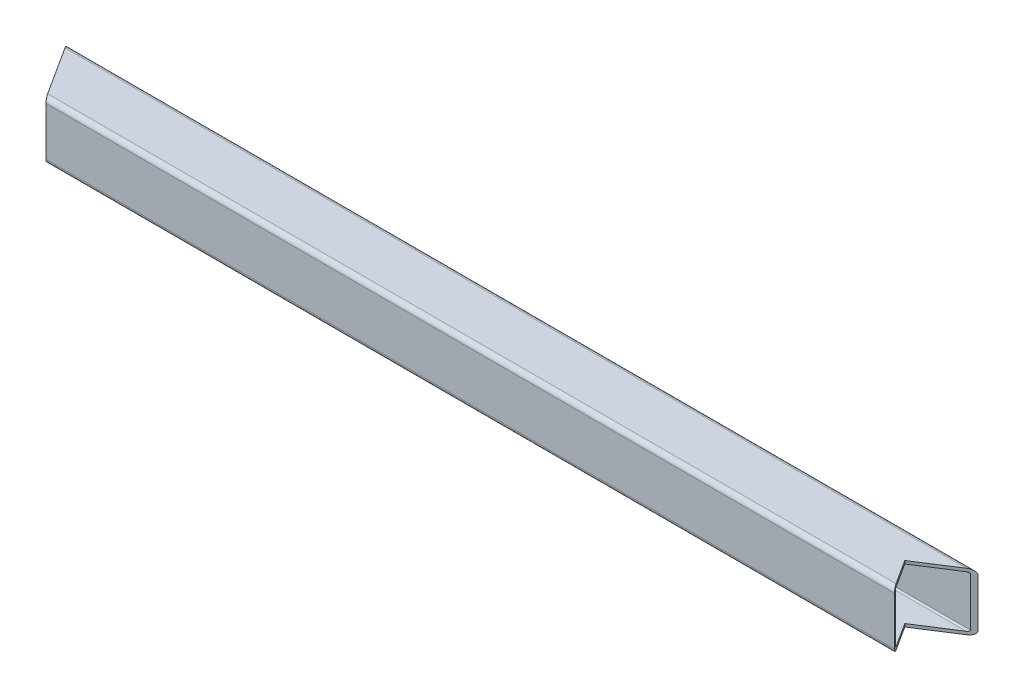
ISO-10303-21;
HEADER;
FILE_DESCRIPTION(('STEP AP214'),'2;1');
FILE_NAME('part.step','',(''),(''),'','','');
FILE_SCHEMA(('AUTOMOTIVE_DESIGN { 1 0 10303 214 1 1 1 1 }'));
ENDSEC;
DATA;
#1=APPLICATION_CONTEXT('core data for automotive mechanical design processes');
#2=APPLICATION_PROTOCOL_DEFINITION('international standard','automotive_design',2000,#1);
#3=PRODUCT_CONTEXT('',#1,'mechanical');
#4=PRODUCT('Part','Part','',(#3));
#5=PRODUCT_RELATED_PRODUCT_CATEGORY('part','',(#4));
#6=PRODUCT_DEFINITION_FORMATION('','',#4);
#7=PRODUCT_DEFINITION_CONTEXT('part definition',#1,'design');
#8=PRODUCT_DEFINITION('design','',#6,#7);
#9=PRODUCT_DEFINITION_SHAPE('','',#8);
#10=(LENGTH_UNIT() NAMED_UNIT(*) SI_UNIT(.MILLI.,.METRE.));
#11=(NAMED_UNIT(*) PLANE_ANGLE_UNIT() SI_UNIT($,.RADIAN.));
#12=(NAMED_UNIT(*) SI_UNIT($,.STERADIAN.) SOLID_ANGLE_UNIT());
#13=UNCERTAINTY_MEASURE_WITH_UNIT(LENGTH_MEASURE(1.E-05),#10,'distance_accuracy_value','');
#14=(GEOMETRIC_REPRESENTATION_CONTEXT(3) GLOBAL_UNCERTAINTY_ASSIGNED_CONTEXT((#13)) GLOBAL_UNIT_ASSIGNED_CONTEXT((#10,
#11,#12)) REPRESENTATION_CONTEXT('',''));
#15=CARTESIAN_POINT('',(0.,0.,0.));
#16=DIRECTION('',(0.,0.,1.));
#17=DIRECTION('',(1.,0.,0.));
#18=AXIS2_PLACEMENT_3D('',#15,#16,#17);
#19=CARTESIAN_POINT('',(698.5,2.54,29.21));
#20=DIRECTION('',(-1.,0.,0.));
#21=DIRECTION('',(0.,0.,1.));
#22=AXIS2_PLACEMENT_3D('',#19,#20,#21);
#23=CYLINDRICAL_SURFACE('',#22,2.54);
#24=DIRECTION('',(-1.,0.,0.));
#25=VECTOR('',#24,1.);
#26=CARTESIAN_POINT('',(698.5,2.54000000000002,31.75));
#27=LINE('',#26,#25);
#28=CARTESIAN_POINT('',(571.772242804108,2.54000000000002,31.75));
#29=VERTEX_POINT('',#28);
#30=CARTESIAN_POINT('',(103.965229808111,2.54000000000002,31.75));
#31=VERTEX_POINT('',#30);
#32=EDGE_CURVE('E238',#29,#31,#27,.T.);
#33=ORIENTED_EDGE('',*,*,#32,.T.);
#34=CARTESIAN_POINT('',(102.335080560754,2.54,29.21));
#35=DIRECTION('',(0.84158635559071,0.,-0.540122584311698));
#36=DIRECTION('',(-0.540122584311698,0.,-0.84158635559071));
#37=AXIS2_PLACEMENT_3D('',#34,#35,#36);
#38=ELLIPSE('',#37,3.01810976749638,2.54);
#39=CARTESIAN_POINT('',(102.335080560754,0.,29.21));
#40=VERTEX_POINT('',#39);
#41=EDGE_CURVE('E54',#31,#40,#38,.T.);
#42=ORIENTED_EDGE('',*,*,#41,.T.);
#43=DIRECTION('',(-1.,0.,0.));
#44=VECTOR('',#43,1.);
#45=CARTESIAN_POINT('',(698.5,0.,29.21));
#46=LINE('',#45,#44);
#47=CARTESIAN_POINT('',(570.142093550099,0.,29.21));
#48=VERTEX_POINT('',#47);
#49=EDGE_CURVE('E180',#48,#40,#46,.T.);
#50=ORIENTED_EDGE('',*,*,#49,.F.);
#51=CARTESIAN_POINT('',(570.142093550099,2.54,29.21));
#52=DIRECTION('',(-0.84158635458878,0.,0.540122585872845));
#53=DIRECTION('',(-0.540122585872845,0.,-0.84158635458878));
#54=AXIS2_PLACEMENT_3D('',#51,#52,#53);
#55=ELLIPSE('',#54,3.01810977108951,2.54);
#56=EDGE_CURVE('E220',#48,#29,#55,.T.);
#57=ORIENTED_EDGE('',*,*,#56,.T.);
#58=EDGE_LOOP('',(#33,#42,#50,#57));
#59=FACE_BOUND('',#58,.T.);
#60=ADVANCED_FACE('F40',(#59),#23,.T.);
#61=CARTESIAN_POINT('',(698.5,0.,29.21));
#62=DIRECTION('',(0.,1.,0.));
#63=DIRECTION('',(0.,0.,1.));
#64=AXIS2_PLACEMENT_3D('',#61,#62,#63);
#65=PLANE('',#64);
#66=ORIENTED_EDGE('',*,*,#49,.T.);
#67=DIRECTION('',(0.540122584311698,0.,0.84158635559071));
#68=VECTOR('',#67,1.);
#69=CARTESIAN_POINT('',(98.4848638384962,0.,23.2108250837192));
#70=LINE('',#69,#68);
#71=CARTESIAN_POINT('',(85.2185134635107,0.,2.54000000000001));
#72=VERTEX_POINT('',#71);
#73=EDGE_CURVE('E164',#72,#40,#70,.T.);
#74=ORIENTED_EDGE('',*,*,#73,.F.);
#75=DIRECTION('',(-1.,0.,0.));
#76=VECTOR('',#75,1.);
#77=CARTESIAN_POINT('',(698.5,0.,2.54000000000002));
#78=LINE('',#77,#76);
#79=CARTESIAN_POINT('',(582.145965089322,0.,2.54000000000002));
#80=VERTEX_POINT('',#79);
#81=EDGE_CURVE('E177',#80,#72,#78,.T.);
#82=ORIENTED_EDGE('',*,*,#81,.F.);
#83=DIRECTION('',(0.841586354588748,0.,-0.540122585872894));
#84=VECTOR('',#83,1.);
#85=CARTESIAN_POINT('',(170.985425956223,0.,266.419152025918));
#86=LINE('',#85,#84);
#87=CARTESIAN_POINT('',(561.520902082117,0.,15.7769807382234));
#88=VERTEX_POINT('',#87);
#89=EDGE_CURVE('E270',#88,#80,#86,.T.);
#90=ORIENTED_EDGE('',*,*,#89,.F.);
#91=DIRECTION('',(-0.540122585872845,0.,-0.84158635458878));
#92=VECTOR('',#91,1.);
#93=CARTESIAN_POINT('',(390.535476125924,0.,-250.642171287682));
#94=LINE('',#93,#92);
#95=EDGE_CURVE('E268',#48,#88,#94,.T.);
#96=ORIENTED_EDGE('',*,*,#95,.F.);
#97=EDGE_LOOP('',(#66,#74,#82,#90,#96));
#98=FACE_BOUND('',#97,.T.);
#99=ADVANCED_FACE('F175',(#98),#65,.F.);
#100=CARTESIAN_POINT('',(698.5,2.54,2.54));
#101=DIRECTION('',(-1.,0.,0.));
#102=DIRECTION('',(0.,0.,1.));
#103=AXIS2_PLACEMENT_3D('',#100,#101,#102);
#104=CYLINDRICAL_SURFACE('',#103,2.54);
#105=ORIENTED_EDGE('',*,*,#81,.T.);
#106=CARTESIAN_POINT('',(85.2185134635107,2.54,2.54));
#107=DIRECTION('',(0.84158635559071,0.,-0.540122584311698));
#108=DIRECTION('',(-0.540122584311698,0.,-0.84158635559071));
#109=AXIS2_PLACEMENT_3D('',#106,#107,#108);
#110=ELLIPSE('',#109,3.01810976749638,2.54);
#111=CARTESIAN_POINT('',(83.5883642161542,2.54000000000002,0.));
#112=VERTEX_POINT('',#111);
#113=EDGE_CURVE('E161',#72,#112,#110,.T.);
#114=ORIENTED_EDGE('',*,*,#113,.T.);
#115=DIRECTION('',(-1.,0.,0.));
#116=VECTOR('',#115,1.);
#117=CARTESIAN_POINT('',(698.5,2.54000000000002,0.));
#118=LINE('',#117,#116);
#119=CARTESIAN_POINT('',(586.103639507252,2.54000000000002,0.));
#120=VERTEX_POINT('',#119);
#121=EDGE_CURVE('E185',#120,#112,#118,.T.);
#122=ORIENTED_EDGE('',*,*,#121,.F.);
#123=CARTESIAN_POINT('',(582.145965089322,2.54,2.54));
#124=DIRECTION('',(-0.540122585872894,0.,-0.841586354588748));
#125=DIRECTION('',(-0.841586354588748,0.,0.540122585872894));
#126=AXIS2_PLACEMENT_3D('',#123,#124,#125);
#127=ELLIPSE('',#126,4.70263615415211,2.54);
#128=EDGE_CURVE('E184',#120,#80,#127,.T.);
#129=ORIENTED_EDGE('',*,*,#128,.T.);
#130=EDGE_LOOP('',(#105,#114,#122,#129));
#131=FACE_BOUND('',#130,.T.);
#132=ADVANCED_FACE('F183',(#131),#104,.T.);
#133=CARTESIAN_POINT('',(698.5,2.54000000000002,0.));
#134=DIRECTION('',(0.,0.,1.));
#135=DIRECTION('',(1.,0.,0.));
#136=AXIS2_PLACEMENT_3D('',#133,#134,#135);
#137=PLANE('',#136);
#138=ORIENTED_EDGE('',*,*,#121,.T.);
#139=DIRECTION('',(0.,1.,0.));
#140=VECTOR('',#139,1.);
#141=CARTESIAN_POINT('',(83.5883642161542,2.54000000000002,0.));
#142=LINE('',#141,#140);
#143=CARTESIAN_POINT('',(83.5883642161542,29.21,0.));
#144=VERTEX_POINT('',#143);
#145=EDGE_CURVE('E166',#112,#144,#142,.T.);
#146=ORIENTED_EDGE('',*,*,#145,.T.);
#147=DIRECTION('',(-1.,0.,0.));
#148=VECTOR('',#147,1.);
#149=CARTESIAN_POINT('',(698.5,29.21,0.));
#150=LINE('',#149,#148);
#151=CARTESIAN_POINT('',(586.103639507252,29.21,0.));
#152=VERTEX_POINT('',#151);
#153=EDGE_CURVE('E189',#152,#144,#150,.T.);
#154=ORIENTED_EDGE('',*,*,#153,.F.);
#155=DIRECTION('',(0.,-1.,0.));
#156=VECTOR('',#155,1.);
#157=CARTESIAN_POINT('',(586.103639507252,2.54000000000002,0.));
#158=LINE('',#157,#156);
#159=EDGE_CURVE('E261',#152,#120,#158,.T.);
#160=ORIENTED_EDGE('',*,*,#159,.T.);
#161=EDGE_LOOP('',(#138,#146,#154,#160));
#162=FACE_BOUND('',#161,.T.);
#163=ADVANCED_FACE('F260',(#162),#137,.F.);
#164=CARTESIAN_POINT('',(698.5,29.21,2.54));
#165=DIRECTION('',(-1.,0.,0.));
#166=DIRECTION('',(0.,0.,1.));
#167=AXIS2_PLACEMENT_3D('',#164,#165,#166);
#168=CYLINDRICAL_SURFACE('',#167,2.54);
#169=ORIENTED_EDGE('',*,*,#153,.T.);
#170=CARTESIAN_POINT('',(85.2185134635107,29.21,2.54));
#171=DIRECTION('',(0.84158635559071,0.,-0.540122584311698));
#172=DIRECTION('',(-0.540122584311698,0.,-0.84158635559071));
#173=AXIS2_PLACEMENT_3D('',#170,#171,#172);
#174=ELLIPSE('',#173,3.01810976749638,2.54);
#175=CARTESIAN_POINT('',(85.2185134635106,31.75,2.53999999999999));
#176=VERTEX_POINT('',#175);
#177=EDGE_CURVE('E256',#144,#176,#174,.T.);
#178=ORIENTED_EDGE('',*,*,#177,.T.);
#179=DIRECTION('',(-1.,0.,0.));
#180=VECTOR('',#179,1.);
#181=CARTESIAN_POINT('',(698.5,31.75,2.54000000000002));
#182=LINE('',#181,#180);
#183=CARTESIAN_POINT('',(582.145965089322,31.75,2.54000000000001));
#184=VERTEX_POINT('',#183);
#185=EDGE_CURVE('E247',#184,#176,#182,.T.);
#186=ORIENTED_EDGE('',*,*,#185,.F.);
#187=CARTESIAN_POINT('',(582.145965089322,29.21,2.54));
#188=DIRECTION('',(-0.540122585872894,0.,-0.841586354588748));
#189=DIRECTION('',(-0.841586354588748,0.,0.540122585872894));
#190=AXIS2_PLACEMENT_3D('',#187,#188,#189);
#191=ELLIPSE('',#190,4.70263615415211,2.54);
#192=EDGE_CURVE('E257',#184,#152,#191,.T.);
#193=ORIENTED_EDGE('',*,*,#192,.T.);
#194=EDGE_LOOP('',(#169,#178,#186,#193));
#195=FACE_BOUND('',#194,.T.);
#196=ADVANCED_FACE('F254',(#195),#168,.T.);
#197=CARTESIAN_POINT('',(698.5,31.75,2.54000000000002));
#198=DIRECTION('',(0.,-1.,0.));
#199=DIRECTION('',(0.,0.,-1.));
#200=AXIS2_PLACEMENT_3D('',#197,#198,#199);
#201=PLANE('',#200);
#202=ORIENTED_EDGE('',*,*,#185,.T.);
#203=DIRECTION('',(0.540122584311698,0.,0.84158635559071));
#204=VECTOR('',#203,1.);
#205=CARTESIAN_POINT('',(264.132597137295,31.7499999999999,281.313108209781));
#206=LINE('',#205,#204);
#207=CARTESIAN_POINT('',(102.335080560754,31.75,29.21));
#208=VERTEX_POINT('',#207);
#209=EDGE_CURVE('E263',#176,#208,#206,.T.);
#210=ORIENTED_EDGE('',*,*,#209,.T.);
#211=DIRECTION('',(-1.,0.,0.));
#212=VECTOR('',#211,1.);
#213=CARTESIAN_POINT('',(698.5,31.75,29.21));
#214=LINE('',#213,#212);
#215=CARTESIAN_POINT('',(570.142093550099,31.75,29.21));
#216=VERTEX_POINT('',#215);
#217=EDGE_CURVE('E244',#216,#208,#214,.T.);
#218=ORIENTED_EDGE('',*,*,#217,.F.);
#219=DIRECTION('',(-0.540122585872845,0.,-0.84158635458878));
#220=VECTOR('',#219,1.);
#221=CARTESIAN_POINT('',(595.465144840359,31.75,68.6668473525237));
#222=LINE('',#221,#220);
#223=CARTESIAN_POINT('',(561.520902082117,31.75,15.7769807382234));
#224=VERTEX_POINT('',#223);
#225=EDGE_CURVE('E299',#216,#224,#222,.T.);
#226=ORIENTED_EDGE('',*,*,#225,.T.);
#227=DIRECTION('',(0.841586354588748,0.,-0.540122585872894));
#228=VECTOR('',#227,1.);
#229=CARTESIAN_POINT('',(664.555757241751,31.75,-50.3498666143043));
#230=LINE('',#229,#228);
#231=EDGE_CURVE('E282',#224,#184,#230,.T.);
#232=ORIENTED_EDGE('',*,*,#231,.T.);
#233=EDGE_LOOP('',(#202,#210,#218,#226,#232));
#234=FACE_BOUND('',#233,.T.);
#235=ADVANCED_FACE('F319',(#234),#201,.F.);
#236=CARTESIAN_POINT('',(698.5,29.21,29.21));
#237=DIRECTION('',(-1.,0.,0.));
#238=DIRECTION('',(0.,0.,1.));
#239=AXIS2_PLACEMENT_3D('',#236,#237,#238);
#240=CYLINDRICAL_SURFACE('',#239,2.54);
#241=ORIENTED_EDGE('',*,*,#217,.T.);
#242=CARTESIAN_POINT('',(102.335080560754,29.21,29.21));
#243=DIRECTION('',(0.84158635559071,0.,-0.540122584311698));
#244=DIRECTION('',(-0.540122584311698,0.,-0.84158635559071));
#245=AXIS2_PLACEMENT_3D('',#242,#243,#244);
#246=ELLIPSE('',#245,3.01810976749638,2.54);
#247=CARTESIAN_POINT('',(103.965229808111,29.21,31.75));
#248=VERTEX_POINT('',#247);
#249=EDGE_CURVE('E309',#208,#248,#246,.T.);
#250=ORIENTED_EDGE('',*,*,#249,.T.);
#251=DIRECTION('',(-1.,0.,0.));
#252=VECTOR('',#251,1.);
#253=CARTESIAN_POINT('',(698.5,29.21,31.75));
#254=LINE('',#253,#252);
#255=CARTESIAN_POINT('',(571.772242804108,29.21,31.75));
#256=VERTEX_POINT('',#255);
#257=EDGE_CURVE('E241',#256,#248,#254,.T.);
#258=ORIENTED_EDGE('',*,*,#257,.F.);
#259=CARTESIAN_POINT('',(570.142093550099,29.21,29.21));
#260=DIRECTION('',(-0.84158635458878,0.,0.540122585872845));
#261=DIRECTION('',(-0.540122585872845,0.,-0.84158635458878));
#262=AXIS2_PLACEMENT_3D('',#259,#260,#261);
#263=ELLIPSE('',#262,3.01810977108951,2.54);
#264=EDGE_CURVE('E296',#256,#216,#263,.T.);
#265=ORIENTED_EDGE('',*,*,#264,.T.);
#266=EDGE_LOOP('',(#241,#250,#258,#265));
#267=FACE_BOUND('',#266,.T.);
#268=ADVANCED_FACE('F321',(#267),#240,.T.);
#269=CARTESIAN_POINT('',(698.5,29.21,31.75));
#270=DIRECTION('',(0.,0.,-1.));
#271=DIRECTION('',(0.,1.,0.));
#272=AXIS2_PLACEMENT_3D('',#269,#270,#271);
#273=PLANE('',#272);
#274=ORIENTED_EDGE('',*,*,#257,.T.);
#275=DIRECTION('',(0.,-1.,0.));
#276=VECTOR('',#275,1.);
#277=CARTESIAN_POINT('',(103.965229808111,29.2100000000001,31.75));
#278=LINE('',#277,#276);
#279=EDGE_CURVE('E307',#248,#31,#278,.T.);
#280=ORIENTED_EDGE('',*,*,#279,.T.);
#281=ORIENTED_EDGE('',*,*,#32,.F.);
#282=DIRECTION('',(0.,1.,0.));
#283=VECTOR('',#282,1.);
#284=CARTESIAN_POINT('',(571.772242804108,29.21,31.75));
#285=LINE('',#284,#283);
#286=EDGE_CURVE('E293',#29,#256,#285,.T.);
#287=ORIENTED_EDGE('',*,*,#286,.T.);
#288=EDGE_LOOP('',(#274,#280,#281,#287));
#289=FACE_BOUND('',#288,.T.);
#290=ADVANCED_FACE('F305',(#289),#273,.F.);
#291=CARTESIAN_POINT('',(698.5,2.54,2.54));
#292=DIRECTION('',(-1.,0.,0.));
#293=DIRECTION('',(0.,0.,1.));
#294=AXIS2_PLACEMENT_3D('',#291,#292,#293);
#295=CYLINDRICAL_SURFACE('',#294,0.889);
#296=CARTESIAN_POINT('',(85.2185134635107,2.54,2.54));
#297=DIRECTION('',(0.84158635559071,0.,-0.540122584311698));
#298=DIRECTION('',(-0.540122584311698,0.,-0.84158635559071));
#299=AXIS2_PLACEMENT_3D('',#296,#297,#298);
#300=ELLIPSE('',#299,1.05633841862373,0.889);
#301=CARTESIAN_POINT('',(85.2185134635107,1.651,2.54000000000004));
#302=VERTEX_POINT('',#301);
#303=CARTESIAN_POINT('',(84.6479612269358,2.54000000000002,1.651));
#304=VERTEX_POINT('',#303);
#305=EDGE_CURVE('E310',#302,#304,#300,.T.);
#306=ORIENTED_EDGE('',*,*,#305,.F.);
#307=DIRECTION('',(-1.,0.,0.));
#308=VECTOR('',#307,1.);
#309=CARTESIAN_POINT('',(698.5,1.651,2.54000000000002));
#310=LINE('',#309,#308);
#311=CARTESIAN_POINT('',(582.145965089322,1.651,2.54000000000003));
#312=VERTEX_POINT('',#311);
#313=EDGE_CURVE('E216',#312,#302,#310,.T.);
#314=ORIENTED_EDGE('',*,*,#313,.F.);
#315=CARTESIAN_POINT('',(582.145965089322,2.54,2.54));
#316=DIRECTION('',(-0.540122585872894,0.,-0.841586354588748));
#317=DIRECTION('',(-0.841586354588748,0.,0.540122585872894));
#318=AXIS2_PLACEMENT_3D('',#315,#316,#317);
#319=ELLIPSE('',#318,1.64592265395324,0.889);
#320=CARTESIAN_POINT('',(583.531151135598,2.54000000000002,1.651));
#321=VERTEX_POINT('',#320);
#322=EDGE_CURVE('E274',#321,#312,#319,.T.);
#323=ORIENTED_EDGE('',*,*,#322,.F.);
#324=DIRECTION('',(-1.,0.,0.));
#325=VECTOR('',#324,1.);
#326=CARTESIAN_POINT('',(698.5,2.54000000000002,1.651));
#327=LINE('',#326,#325);
#328=EDGE_CURVE('E235',#321,#304,#327,.T.);
#329=ORIENTED_EDGE('',*,*,#328,.T.);
#330=EDGE_LOOP('',(#306,#314,#323,#329));
#331=FACE_BOUND('',#330,.T.);
#332=ADVANCED_FACE('F331',(#331),#295,.F.);
#333=CARTESIAN_POINT('',(698.5,2.54000000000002,1.651));
#334=DIRECTION('',(0.,0.,1.));
#335=DIRECTION('',(1.,0.,0.));
#336=AXIS2_PLACEMENT_3D('',#333,#334,#335);
#337=PLANE('',#336);
#338=DIRECTION('',(0.,1.,0.));
#339=VECTOR('',#338,1.);
#340=CARTESIAN_POINT('',(84.6479612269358,2.54000000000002,1.651));
#341=LINE('',#340,#339);
#342=CARTESIAN_POINT('',(84.647961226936,29.21,1.651));
#343=VERTEX_POINT('',#342);
#344=EDGE_CURVE('E313',#304,#343,#341,.T.);
#345=ORIENTED_EDGE('',*,*,#344,.F.);
#346=ORIENTED_EDGE('',*,*,#328,.F.);
#347=DIRECTION('',(0.,-1.,0.));
#348=VECTOR('',#347,1.);
#349=CARTESIAN_POINT('',(583.531151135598,2.54000000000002,1.651));
#350=LINE('',#349,#348);
#351=CARTESIAN_POINT('',(583.531151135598,29.21,1.651));
#352=VERTEX_POINT('',#351);
#353=EDGE_CURVE('E276',#352,#321,#350,.T.);
#354=ORIENTED_EDGE('',*,*,#353,.F.);
#355=DIRECTION('',(-1.,0.,0.));
#356=VECTOR('',#355,1.);
#357=CARTESIAN_POINT('',(698.5,29.21,1.651));
#358=LINE('',#357,#356);
#359=EDGE_CURVE('E232',#352,#343,#358,.T.);
#360=ORIENTED_EDGE('',*,*,#359,.T.);
#361=EDGE_LOOP('',(#345,#346,#354,#360));
#362=FACE_BOUND('',#361,.T.);
#363=ADVANCED_FACE('F336',(#362),#337,.T.);
#364=CARTESIAN_POINT('',(698.5,29.21,2.54));
#365=DIRECTION('',(-1.,0.,0.));
#366=DIRECTION('',(0.,0.,1.));
#367=AXIS2_PLACEMENT_3D('',#364,#365,#366);
#368=CYLINDRICAL_SURFACE('',#367,0.889);
#369=CARTESIAN_POINT('',(85.2185134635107,29.21,2.54));
#370=DIRECTION('',(0.84158635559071,0.,-0.540122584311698));
#371=DIRECTION('',(-0.540122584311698,0.,-0.84158635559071));
#372=AXIS2_PLACEMENT_3D('',#369,#370,#371);
#373=ELLIPSE('',#372,1.05633841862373,0.889);
#374=CARTESIAN_POINT('',(85.2185134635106,30.099,2.53999999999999));
#375=VERTEX_POINT('',#374);
#376=EDGE_CURVE('E339',#343,#375,#373,.T.);
#377=ORIENTED_EDGE('',*,*,#376,.F.);
#378=ORIENTED_EDGE('',*,*,#359,.F.);
#379=CARTESIAN_POINT('',(582.145965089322,29.21,2.54));
#380=DIRECTION('',(-0.540122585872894,0.,-0.841586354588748));
#381=DIRECTION('',(-0.841586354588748,0.,0.540122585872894));
#382=AXIS2_PLACEMENT_3D('',#379,#380,#381);
#383=ELLIPSE('',#382,1.64592265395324,0.889);
#384=CARTESIAN_POINT('',(582.145965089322,30.099,2.54000000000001));
#385=VERTEX_POINT('',#384);
#386=EDGE_CURVE('E278',#385,#352,#383,.T.);
#387=ORIENTED_EDGE('',*,*,#386,.F.);
#388=DIRECTION('',(-1.,0.,0.));
#389=VECTOR('',#388,1.);
#390=CARTESIAN_POINT('',(698.5,30.099,2.54000000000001));
#391=LINE('',#390,#389);
#392=EDGE_CURVE('E229',#385,#375,#391,.T.);
#393=ORIENTED_EDGE('',*,*,#392,.T.);
#394=EDGE_LOOP('',(#377,#378,#387,#393));
#395=FACE_BOUND('',#394,.T.);
#396=ADVANCED_FACE('F364',(#395),#368,.F.);
#397=CARTESIAN_POINT('',(698.5,30.099,2.54000000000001));
#398=DIRECTION('',(0.,-1.,0.));
#399=DIRECTION('',(0.,0.,-1.));
#400=AXIS2_PLACEMENT_3D('',#397,#398,#399);
#401=PLANE('',#400);
#402=DIRECTION('',(0.540122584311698,0.,0.84158635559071));
#403=VECTOR('',#402,1.);
#404=CARTESIAN_POINT('',(264.132597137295,30.099,281.313108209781));
#405=LINE('',#404,#403);
#406=CARTESIAN_POINT('',(102.335080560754,30.099,29.21));
#407=VERTEX_POINT('',#406);
#408=EDGE_CURVE('E340',#375,#407,#405,.T.);
#409=ORIENTED_EDGE('',*,*,#408,.F.);
#410=ORIENTED_EDGE('',*,*,#392,.F.);
#411=DIRECTION('',(0.841586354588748,0.,-0.540122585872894));
#412=VECTOR('',#411,1.);
#413=CARTESIAN_POINT('',(664.555757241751,30.099,-50.3498666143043));
#414=LINE('',#413,#412);
#415=CARTESIAN_POINT('',(561.520902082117,30.099,15.7769807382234));
#416=VERTEX_POINT('',#415);
#417=EDGE_CURVE('E280',#416,#385,#414,.T.);
#418=ORIENTED_EDGE('',*,*,#417,.F.);
#419=DIRECTION('',(-0.540122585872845,0.,-0.84158635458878));
#420=VECTOR('',#419,1.);
#421=CARTESIAN_POINT('',(595.465144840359,30.099,68.6668473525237));
#422=LINE('',#421,#420);
#423=CARTESIAN_POINT('',(570.142093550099,30.099,29.21));
#424=VERTEX_POINT('',#423);
#425=EDGE_CURVE('E291',#424,#416,#422,.T.);
#426=ORIENTED_EDGE('',*,*,#425,.F.);
#427=DIRECTION('',(-1.,0.,0.));
#428=VECTOR('',#427,1.);
#429=CARTESIAN_POINT('',(698.5,30.099,29.21));
#430=LINE('',#429,#428);
#431=EDGE_CURVE('E226',#424,#407,#430,.T.);
#432=ORIENTED_EDGE('',*,*,#431,.T.);
#433=EDGE_LOOP('',(#409,#410,#418,#426,#432));
#434=FACE_BOUND('',#433,.T.);
#435=ADVANCED_FACE('F360',(#434),#401,.T.);
#436=CARTESIAN_POINT('',(698.5,29.21,29.21));
#437=DIRECTION('',(-1.,0.,0.));
#438=DIRECTION('',(0.,0.,1.));
#439=AXIS2_PLACEMENT_3D('',#436,#437,#438);
#440=CYLINDRICAL_SURFACE('',#439,0.889000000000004);
#441=CARTESIAN_POINT('',(102.335080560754,29.21,29.21));
#442=DIRECTION('',(0.84158635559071,0.,-0.540122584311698));
#443=DIRECTION('',(-0.540122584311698,0.,-0.84158635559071));
#444=AXIS2_PLACEMENT_3D('',#441,#442,#443);
#445=ELLIPSE('',#444,1.05633841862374,0.889000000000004);
#446=CARTESIAN_POINT('',(102.905632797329,29.21,30.099));
#447=VERTEX_POINT('',#446);
#448=EDGE_CURVE('E344',#407,#447,#445,.T.);
#449=ORIENTED_EDGE('',*,*,#448,.F.);
#450=ORIENTED_EDGE('',*,*,#431,.F.);
#451=CARTESIAN_POINT('',(570.142093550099,29.21,29.21));
#452=DIRECTION('',(-0.84158635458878,0.,0.540122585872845));
#453=DIRECTION('',(-0.540122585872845,0.,-0.84158635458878));
#454=AXIS2_PLACEMENT_3D('',#451,#452,#453);
#455=ELLIPSE('',#454,1.05633841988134,0.889000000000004);
#456=CARTESIAN_POINT('',(570.712645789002,29.21,30.099));
#457=VERTEX_POINT('',#456);
#458=EDGE_CURVE('E289',#457,#424,#455,.T.);
#459=ORIENTED_EDGE('',*,*,#458,.F.);
#460=DIRECTION('',(-1.,0.,0.));
#461=VECTOR('',#460,1.);
#462=CARTESIAN_POINT('',(698.5,29.21,30.099));
#463=LINE('',#462,#461);
#464=EDGE_CURVE('E218',#457,#447,#463,.T.);
#465=ORIENTED_EDGE('',*,*,#464,.T.);
#466=EDGE_LOOP('',(#449,#450,#459,#465));
#467=FACE_BOUND('',#466,.T.);
#468=ADVANCED_FACE('F357',(#467),#440,.F.);
#469=CARTESIAN_POINT('',(698.5,29.21,30.099));
#470=DIRECTION('',(0.,0.,-1.));
#471=DIRECTION('',(-1.,0.,0.));
#472=AXIS2_PLACEMENT_3D('',#469,#470,#471);
#473=PLANE('',#472);
#474=DIRECTION('',(0.,-1.,0.));
#475=VECTOR('',#474,1.);
#476=CARTESIAN_POINT('',(102.905632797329,29.21,30.099));
#477=LINE('',#476,#475);
#478=CARTESIAN_POINT('',(102.905632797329,2.54000000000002,30.099));
#479=VERTEX_POINT('',#478);
#480=EDGE_CURVE('E346',#447,#479,#477,.T.);
#481=ORIENTED_EDGE('',*,*,#480,.F.);
#482=ORIENTED_EDGE('',*,*,#464,.F.);
#483=DIRECTION('',(0.,1.,0.));
#484=VECTOR('',#483,1.);
#485=CARTESIAN_POINT('',(570.712645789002,29.21,30.099));
#486=LINE('',#485,#484);
#487=CARTESIAN_POINT('',(570.712645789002,2.54000000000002,30.099));
#488=VERTEX_POINT('',#487);
#489=EDGE_CURVE('E212',#488,#457,#486,.T.);
#490=ORIENTED_EDGE('',*,*,#489,.F.);
#491=DIRECTION('',(-1.,0.,0.));
#492=VECTOR('',#491,1.);
#493=CARTESIAN_POINT('',(698.5,2.54000000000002,30.099));
#494=LINE('',#493,#492);
#495=EDGE_CURVE('E211',#488,#479,#494,.T.);
#496=ORIENTED_EDGE('',*,*,#495,.T.);
#497=EDGE_LOOP('',(#481,#482,#490,#496));
#498=FACE_BOUND('',#497,.T.);
#499=ADVANCED_FACE('F352',(#498),#473,.T.);
#500=CARTESIAN_POINT('',(698.5,2.54,29.21));
#501=DIRECTION('',(-1.,0.,0.));
#502=DIRECTION('',(0.,0.,1.));
#503=AXIS2_PLACEMENT_3D('',#500,#501,#502);
#504=CYLINDRICAL_SURFACE('',#503,0.889000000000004);
#505=CARTESIAN_POINT('',(102.335080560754,2.54,29.21));
#506=DIRECTION('',(0.84158635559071,0.,-0.540122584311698));
#507=DIRECTION('',(-0.540122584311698,0.,-0.84158635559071));
#508=AXIS2_PLACEMENT_3D('',#505,#506,#507);
#509=ELLIPSE('',#508,1.05633841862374,0.889000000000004);
#510=CARTESIAN_POINT('',(102.335080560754,1.651,29.21));
#511=VERTEX_POINT('',#510);
#512=EDGE_CURVE('E61',#479,#511,#509,.T.);
#513=ORIENTED_EDGE('',*,*,#512,.F.);
#514=ORIENTED_EDGE('',*,*,#495,.F.);
#515=CARTESIAN_POINT('',(570.142093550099,2.54,29.21));
#516=DIRECTION('',(-0.84158635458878,0.,0.540122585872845));
#517=DIRECTION('',(-0.540122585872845,0.,-0.84158635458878));
#518=AXIS2_PLACEMENT_3D('',#515,#516,#517);
#519=ELLIPSE('',#518,1.05633841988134,0.889000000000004);
#520=CARTESIAN_POINT('',(570.142093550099,1.651,29.21));
#521=VERTEX_POINT('',#520);
#522=EDGE_CURVE('E198',#521,#488,#519,.T.);
#523=ORIENTED_EDGE('',*,*,#522,.F.);
#524=DIRECTION('',(-1.,0.,0.));
#525=VECTOR('',#524,1.);
#526=CARTESIAN_POINT('',(698.5,1.651,29.21));
#527=LINE('',#526,#525);
#528=EDGE_CURVE('E209',#521,#511,#527,.T.);
#529=ORIENTED_EDGE('',*,*,#528,.T.);
#530=EDGE_LOOP('',(#513,#514,#523,#529));
#531=FACE_BOUND('',#530,.T.);
#532=ADVANCED_FACE('F208',(#531),#504,.F.);
#533=CARTESIAN_POINT('',(698.5,1.651,29.21));
#534=DIRECTION('',(0.,1.,0.));
#535=DIRECTION('',(0.,0.,1.));
#536=AXIS2_PLACEMENT_3D('',#533,#534,#535);
#537=PLANE('',#536);
#538=DIRECTION('',(-0.540122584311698,0.,-0.84158635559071));
#539=VECTOR('',#538,1.);
#540=CARTESIAN_POINT('',(276.25570693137,1.651,300.202604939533));
#541=LINE('',#540,#539);
#542=EDGE_CURVE('E12',#511,#302,#541,.T.);
#543=ORIENTED_EDGE('',*,*,#542,.F.);
#544=ORIENTED_EDGE('',*,*,#528,.F.);
#545=DIRECTION('',(0.540122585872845,0.,0.84158635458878));
#546=VECTOR('',#545,1.);
#547=CARTESIAN_POINT('',(607.588254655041,1.651,87.5563440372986));
#548=LINE('',#547,#546);
#549=CARTESIAN_POINT('',(561.520902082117,1.65100000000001,15.7769807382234));
#550=VERTEX_POINT('',#549);
#551=EDGE_CURVE('E47',#550,#521,#548,.T.);
#552=ORIENTED_EDGE('',*,*,#551,.F.);
#553=DIRECTION('',(-0.841586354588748,0.,0.540122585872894));
#554=VECTOR('',#553,1.);
#555=CARTESIAN_POINT('',(652.432647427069,1.651,-42.5693632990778));
#556=LINE('',#555,#554);
#557=EDGE_CURVE('E187',#312,#550,#556,.T.);
#558=ORIENTED_EDGE('',*,*,#557,.F.);
#559=ORIENTED_EDGE('',*,*,#313,.T.);
#560=EDGE_LOOP('',(#543,#544,#552,#558,#559));
#561=FACE_BOUND('',#560,.T.);
#562=ADVANCED_FACE('F214',(#561),#537,.T.);
#563=CARTESIAN_POINT('',(390.535476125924,38.1,-250.642171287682));
#564=DIRECTION('',(-0.84158635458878,0.,0.540122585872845));
#565=DIRECTION('',(0.540122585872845,0.,0.84158635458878));
#566=AXIS2_PLACEMENT_3D('',#563,#564,#565);
#567=PLANE('',#566);
#568=ORIENTED_EDGE('',*,*,#95,.T.);
#569=DIRECTION('',(0.,-1.,0.));
#570=VECTOR('',#569,1.);
#571=CARTESIAN_POINT('',(561.520902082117,38.1,15.7769807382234));
#572=LINE('',#571,#570);
#573=EDGE_CURVE('E201',#550,#88,#572,.T.);
#574=ORIENTED_EDGE('',*,*,#573,.F.);
#575=ORIENTED_EDGE('',*,*,#551,.T.);
#576=ORIENTED_EDGE('',*,*,#522,.T.);
#577=ORIENTED_EDGE('',*,*,#489,.T.);
#578=ORIENTED_EDGE('',*,*,#458,.T.);
#579=ORIENTED_EDGE('',*,*,#425,.T.);
#580=EDGE_CURVE('E273',#224,#416,#572,.T.);
#581=ORIENTED_EDGE('',*,*,#580,.F.);
#582=ORIENTED_EDGE('',*,*,#225,.F.);
#583=ORIENTED_EDGE('',*,*,#264,.F.);
#584=ORIENTED_EDGE('',*,*,#286,.F.);
#585=ORIENTED_EDGE('',*,*,#56,.F.);
#586=EDGE_LOOP('',(#568,#574,#575,#576,#577,#578,#579,#581,#582,#583,#584,#585));
#587=FACE_BOUND('',#586,.T.);
#588=ADVANCED_FACE('F197',(#587),#567,.F.);
#589=CARTESIAN_POINT('',(170.985425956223,38.1,266.419152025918));
#590=DIRECTION('',(-0.540122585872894,0.,-0.841586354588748));
#591=DIRECTION('',(-0.841586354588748,0.,0.540122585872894));
#592=AXIS2_PLACEMENT_3D('',#589,#590,#591);
#593=PLANE('',#592);
#594=ORIENTED_EDGE('',*,*,#159,.F.);
#595=ORIENTED_EDGE('',*,*,#192,.F.);
#596=ORIENTED_EDGE('',*,*,#231,.F.);
#597=ORIENTED_EDGE('',*,*,#580,.T.);
#598=ORIENTED_EDGE('',*,*,#417,.T.);
#599=ORIENTED_EDGE('',*,*,#386,.T.);
#600=ORIENTED_EDGE('',*,*,#353,.T.);
#601=ORIENTED_EDGE('',*,*,#322,.T.);
#602=ORIENTED_EDGE('',*,*,#557,.T.);
#603=ORIENTED_EDGE('',*,*,#573,.T.);
#604=ORIENTED_EDGE('',*,*,#89,.T.);
#605=ORIENTED_EDGE('',*,*,#128,.F.);
#606=EDGE_LOOP('',(#594,#595,#596,#597,#598,#599,#600,#601,#602,#603,#604,#605));
#607=FACE_BOUND('',#606,.T.);
#608=ADVANCED_FACE('F325',(#607),#593,.F.);
#609=CARTESIAN_POINT('',(98.4848638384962,38.1,23.2108250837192));
#610=DIRECTION('',(0.84158635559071,0.,-0.540122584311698));
#611=DIRECTION('',(-0.540122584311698,0.,-0.84158635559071));
#612=AXIS2_PLACEMENT_3D('',#609,#610,#611);
#613=PLANE('',#612);
#614=ORIENTED_EDGE('',*,*,#305,.T.);
#615=ORIENTED_EDGE('',*,*,#344,.T.);
#616=ORIENTED_EDGE('',*,*,#376,.T.);
#617=ORIENTED_EDGE('',*,*,#408,.T.);
#618=ORIENTED_EDGE('',*,*,#448,.T.);
#619=ORIENTED_EDGE('',*,*,#480,.T.);
#620=ORIENTED_EDGE('',*,*,#512,.T.);
#621=ORIENTED_EDGE('',*,*,#542,.T.);
#622=EDGE_LOOP('',(#614,#615,#616,#617,#618,#619,#620,#621));
#623=FACE_BOUND('',#622,.T.);
#624=ORIENTED_EDGE('',*,*,#279,.F.);
#625=ORIENTED_EDGE('',*,*,#249,.F.);
#626=ORIENTED_EDGE('',*,*,#209,.F.);
#627=ORIENTED_EDGE('',*,*,#177,.F.);
#628=ORIENTED_EDGE('',*,*,#145,.F.);
#629=ORIENTED_EDGE('',*,*,#113,.F.);
#630=ORIENTED_EDGE('',*,*,#73,.T.);
#631=ORIENTED_EDGE('',*,*,#41,.F.);
#632=EDGE_LOOP('',(#624,#625,#626,#627,#628,#629,#630,#631));
#633=FACE_BOUND('',#632,.T.);
#634=ADVANCED_FACE('F163',(#623,#633),#613,.F.);
#635=CLOSED_SHELL('',(#60,#99,#132,#163,#196,#235,#268,#290,#332,#363,#396,#435,#468,#499,#532,
#562,#588,#608,#634));
#636=MANIFOLD_SOLID_BREP('B2',#635);
#637=ADVANCED_BREP_SHAPE_REPRESENTATION('',(#18,#636),#14);
#638=SHAPE_DEFINITION_REPRESENTATION(#9,#637);
ENDSEC;
END-ISO-10303-21;
